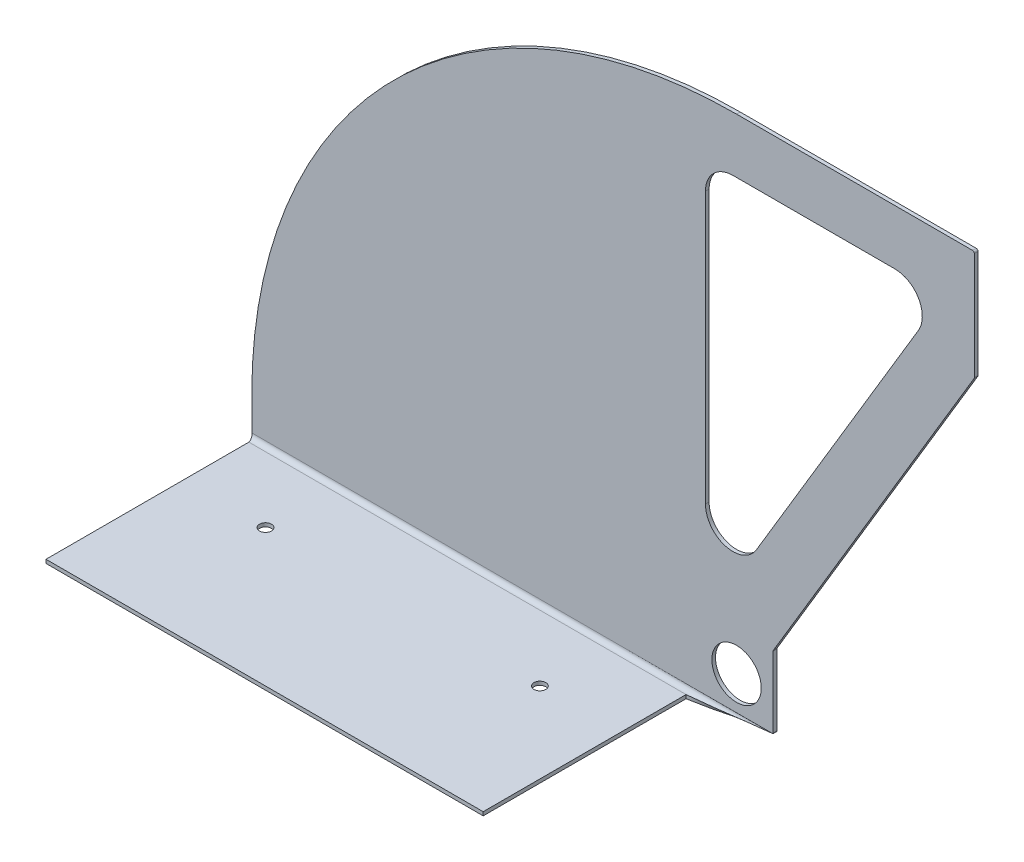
ISO-10303-21;
HEADER;
FILE_DESCRIPTION(('STEP AP214'),'2;1');
FILE_NAME('part.step','',(''),(''),'','','');
FILE_SCHEMA(('AUTOMOTIVE_DESIGN { 1 0 10303 214 1 1 1 1 }'));
ENDSEC;
DATA;
#1=APPLICATION_CONTEXT('core data for automotive mechanical design processes');
#2=APPLICATION_PROTOCOL_DEFINITION('international standard','automotive_design',2000,#1);
#3=PRODUCT_CONTEXT('',#1,'mechanical');
#4=PRODUCT('Part','Part','',(#3));
#5=PRODUCT_RELATED_PRODUCT_CATEGORY('part','',(#4));
#6=PRODUCT_DEFINITION_FORMATION('','',#4);
#7=PRODUCT_DEFINITION_CONTEXT('part definition',#1,'design');
#8=PRODUCT_DEFINITION('design','',#6,#7);
#9=PRODUCT_DEFINITION_SHAPE('','',#8);
#10=(LENGTH_UNIT() NAMED_UNIT(*) SI_UNIT(.MILLI.,.METRE.));
#11=(NAMED_UNIT(*) PLANE_ANGLE_UNIT() SI_UNIT($,.RADIAN.));
#12=(NAMED_UNIT(*) SI_UNIT($,.STERADIAN.) SOLID_ANGLE_UNIT());
#13=UNCERTAINTY_MEASURE_WITH_UNIT(LENGTH_MEASURE(1.E-05),#10,'distance_accuracy_value','');
#14=(GEOMETRIC_REPRESENTATION_CONTEXT(3) GLOBAL_UNCERTAINTY_ASSIGNED_CONTEXT((#13)) GLOBAL_UNIT_ASSIGNED_CONTEXT((#10,
#11,#12)) REPRESENTATION_CONTEXT('',''));
#15=CARTESIAN_POINT('',(0.,0.,0.));
#16=DIRECTION('',(0.,0.,1.));
#17=DIRECTION('',(1.,0.,0.));
#18=AXIS2_PLACEMENT_3D('',#15,#16,#17);
#19=CARTESIAN_POINT('',(-264.,-23.,231.));
#20=DIRECTION('',(0.,1.,0.));
#21=DIRECTION('',(-1.,0.,0.));
#22=AXIS2_PLACEMENT_3D('',#19,#20,#21);
#23=PLANE('',#22);
#24=CARTESIAN_POINT('',(-219.,-23.,40.5));
#25=DIRECTION('',(0.,-1.,0.));
#26=DIRECTION('',(1.,0.,0.));
#27=AXIS2_PLACEMENT_3D('',#24,#25,#26);
#28=CIRCLE('',#27,3.25000000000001);
#29=CARTESIAN_POINT('',(-215.75,-23.,40.5));
#30=VERTEX_POINT('',#29);
#31=EDGE_CURVE('E202',#30,#30,#28,.T.);
#32=ORIENTED_EDGE('',*,*,#31,.F.);
#33=EDGE_LOOP('',(#32));
#34=FACE_BOUND('',#33,.T.);
#35=CARTESIAN_POINT('',(-69.0000000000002,-23.,40.5));
#36=DIRECTION('',(0.,-1.,0.));
#37=DIRECTION('',(1.,0.,0.));
#38=AXIS2_PLACEMENT_3D('',#35,#36,#37);
#39=CIRCLE('',#38,3.25000000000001);
#40=CARTESIAN_POINT('',(-65.7500000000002,-23.,40.5));
#41=VERTEX_POINT('',#40);
#42=EDGE_CURVE('E205',#41,#41,#39,.T.);
#43=ORIENTED_EDGE('',*,*,#42,.F.);
#44=EDGE_LOOP('',(#43));
#45=FACE_BOUND('',#44,.T.);
#46=DIRECTION('',(-1.,0.,0.));
#47=VECTOR('',#46,1.);
#48=CARTESIAN_POINT('',(-264.,-23.,115.499999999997));
#49=LINE('',#48,#47);
#50=CARTESIAN_POINT('',(-25.,-23.,115.499999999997));
#51=VERTEX_POINT('',#50);
#52=CARTESIAN_POINT('',(-264.,-23.,115.499999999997));
#53=VERTEX_POINT('',#52);
#54=EDGE_CURVE('E170',#51,#53,#49,.T.);
#55=ORIENTED_EDGE('',*,*,#54,.T.);
#56=DIRECTION('',(0.,0.,-1.));
#57=VECTOR('',#56,1.);
#58=CARTESIAN_POINT('',(-264.,-23.,231.));
#59=LINE('',#58,#57);
#60=CARTESIAN_POINT('',(-264.,-23.,4.59999999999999));
#61=VERTEX_POINT('',#60);
#62=EDGE_CURVE('E176',#53,#61,#59,.T.);
#63=ORIENTED_EDGE('',*,*,#62,.T.);
#64=DIRECTION('',(-1.,0.,0.));
#65=VECTOR('',#64,1.);
#66=CARTESIAN_POINT('',(-25.,-23.,4.6));
#67=LINE('',#66,#65);
#68=CARTESIAN_POINT('',(-25.,-23.,4.6));
#69=VERTEX_POINT('',#68);
#70=EDGE_CURVE('E189',#69,#61,#67,.T.);
#71=ORIENTED_EDGE('',*,*,#70,.F.);
#72=DIRECTION('',(0.,0.,-1.));
#73=VECTOR('',#72,1.);
#74=CARTESIAN_POINT('',(-25.,-23.,231.));
#75=LINE('',#74,#73);
#76=EDGE_CURVE('E181',#51,#69,#75,.T.);
#77=ORIENTED_EDGE('',*,*,#76,.F.);
#78=EDGE_LOOP('',(#55,#63,#71,#77));
#79=FACE_BOUND('',#78,.T.);
#80=ADVANCED_FACE('F35',(#34,#45,#79),#23,.F.);
#81=CARTESIAN_POINT('',(130.,-21.,2.));
#82=DIRECTION('',(0.,-1.,0.));
#83=DIRECTION('',(0.,0.,-1.));
#84=AXIS2_PLACEMENT_3D('',#81,#82,#83);
#85=PLANE('',#84);
#86=CARTESIAN_POINT('',(-69.0000000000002,-21.,40.5));
#87=DIRECTION('',(0.,-1.,0.));
#88=DIRECTION('',(1.,0.,0.));
#89=AXIS2_PLACEMENT_3D('',#86,#87,#88);
#90=CIRCLE('',#89,3.25000000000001);
#91=CARTESIAN_POINT('',(-65.7500000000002,-21.,40.5));
#92=VERTEX_POINT('',#91);
#93=EDGE_CURVE('E213',#92,#92,#90,.T.);
#94=ORIENTED_EDGE('',*,*,#93,.T.);
#95=EDGE_LOOP('',(#94));
#96=FACE_BOUND('',#95,.T.);
#97=CARTESIAN_POINT('',(-219.,-21.,40.5));
#98=DIRECTION('',(0.,-1.,0.));
#99=DIRECTION('',(1.,0.,0.));
#100=AXIS2_PLACEMENT_3D('',#97,#98,#99);
#101=CIRCLE('',#100,3.25000000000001);
#102=CARTESIAN_POINT('',(-215.75,-21.,40.5));
#103=VERTEX_POINT('',#102);
#104=EDGE_CURVE('E210',#103,#103,#101,.T.);
#105=ORIENTED_EDGE('',*,*,#104,.T.);
#106=EDGE_LOOP('',(#105));
#107=FACE_BOUND('',#106,.T.);
#108=DIRECTION('',(-1.,0.,0.));
#109=VECTOR('',#108,1.);
#110=CARTESIAN_POINT('',(-264.,-21.,115.499999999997));
#111=LINE('',#110,#109);
#112=CARTESIAN_POINT('',(-25.,-21.,115.499999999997));
#113=VERTEX_POINT('',#112);
#114=CARTESIAN_POINT('',(-264.,-21.,115.499999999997));
#115=VERTEX_POINT('',#114);
#116=EDGE_CURVE('E12',#113,#115,#111,.T.);
#117=ORIENTED_EDGE('',*,*,#116,.F.);
#118=DIRECTION('',(0.,0.,1.));
#119=VECTOR('',#118,1.);
#120=CARTESIAN_POINT('',(-25.,-21.,231.));
#121=LINE('',#120,#119);
#122=CARTESIAN_POINT('',(-25.,-21.,4.6));
#123=VERTEX_POINT('',#122);
#124=EDGE_CURVE('E184',#123,#113,#121,.T.);
#125=ORIENTED_EDGE('',*,*,#124,.F.);
#126=DIRECTION('',(1.,0.,0.));
#127=VECTOR('',#126,1.);
#128=CARTESIAN_POINT('',(-25.,-21.,4.6));
#129=LINE('',#128,#127);
#130=CARTESIAN_POINT('',(-264.,-21.,4.6));
#131=VERTEX_POINT('',#130);
#132=EDGE_CURVE('E185',#131,#123,#129,.T.);
#133=ORIENTED_EDGE('',*,*,#132,.F.);
#134=DIRECTION('',(0.,0.,1.));
#135=VECTOR('',#134,1.);
#136=CARTESIAN_POINT('',(-264.,-21.,231.));
#137=LINE('',#136,#135);
#138=EDGE_CURVE('E193',#131,#115,#137,.T.);
#139=ORIENTED_EDGE('',*,*,#138,.T.);
#140=EDGE_LOOP('',(#117,#125,#133,#139));
#141=FACE_BOUND('',#140,.T.);
#142=ADVANCED_FACE('F236',(#96,#107,#141),#85,.F.);
#143=CARTESIAN_POINT('',(-25.,631.123423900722,231.));
#144=DIRECTION('',(1.,0.,0.));
#145=DIRECTION('',(0.,0.,-1.));
#146=AXIS2_PLACEMENT_3D('',#143,#144,#145);
#147=PLANE('',#146);
#148=ORIENTED_EDGE('',*,*,#124,.T.);
#149=DIRECTION('',(0.,-1.,0.));
#150=VECTOR('',#149,1.);
#151=CARTESIAN_POINT('',(-25.,-23.,115.499999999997));
#152=LINE('',#151,#150);
#153=EDGE_CURVE('E44',#51,#113,#152,.F.);
#154=ORIENTED_EDGE('',*,*,#153,.F.);
#155=ORIENTED_EDGE('',*,*,#76,.T.);
#156=CARTESIAN_POINT('',(-25.,-21.,4.6));
#157=CARTESIAN_POINT('',(-25.,-23.,4.6));
#158=B_SPLINE_CURVE_WITH_KNOTS('',1,(#156,#157),.UNSPECIFIED.,.F.,.F.,(2,2),(0.,1.),.UNSPECIFIED.);
#159=EDGE_CURVE('E295',#123,#69,#158,.T.);
#160=ORIENTED_EDGE('',*,*,#159,.F.);
#161=EDGE_LOOP('',(#148,#154,#155,#160));
#162=FACE_BOUND('',#161,.T.);
#163=ADVANCED_FACE('F179',(#162),#147,.T.);
#164=CARTESIAN_POINT('',(-264.,631.123423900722,231.));
#165=DIRECTION('',(-1.,0.,0.));
#166=DIRECTION('',(0.,0.,1.));
#167=AXIS2_PLACEMENT_3D('',#164,#165,#166);
#168=PLANE('',#167);
#169=ORIENTED_EDGE('',*,*,#62,.F.);
#170=DIRECTION('',(0.,-1.,0.));
#171=VECTOR('',#170,1.);
#172=CARTESIAN_POINT('',(-264.,-23.,115.499999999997));
#173=LINE('',#172,#171);
#174=EDGE_CURVE('E172',#53,#115,#173,.F.);
#175=ORIENTED_EDGE('',*,*,#174,.T.);
#176=ORIENTED_EDGE('',*,*,#138,.F.);
#177=CARTESIAN_POINT('',(-264.,-23.,4.6));
#178=CARTESIAN_POINT('',(-264.,-21.,4.6));
#179=B_SPLINE_CURVE_WITH_KNOTS('',1,(#177,#178),.UNSPECIFIED.,.F.,.F.,(2,2),(0.,1.),.UNSPECIFIED.);
#180=EDGE_CURVE('E191',#131,#61,#179,.F.);
#181=ORIENTED_EDGE('',*,*,#180,.T.);
#182=EDGE_LOOP('',(#169,#175,#176,#181));
#183=FACE_BOUND('',#182,.T.);
#184=ADVANCED_FACE('F372',(#183),#168,.T.);
#185=CARTESIAN_POINT('',(-17.,71.8982523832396,231.));
#186=DIRECTION('',(1.,0.,0.));
#187=DIRECTION('',(0.,1.,0.));
#188=AXIS2_PLACEMENT_3D('',#185,#186,#187);
#189=PLANE('',#188);
#190=DIRECTION('',(0.,1.,0.));
#191=VECTOR('',#190,1.);
#192=CARTESIAN_POINT('',(-17.,71.8982523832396,2.));
#193=LINE('',#192,#191);
#194=CARTESIAN_POINT('',(-17.,71.8982523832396,2.));
#195=VERTEX_POINT('',#194);
#196=CARTESIAN_POINT('',(-17.,220.,2.00000000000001));
#197=VERTEX_POINT('',#196);
#198=EDGE_CURVE('E907',#195,#197,#193,.T.);
#199=ORIENTED_EDGE('',*,*,#198,.F.);
#200=DIRECTION('',(0.,0.,-1.));
#201=VECTOR('',#200,1.);
#202=CARTESIAN_POINT('',(-17.,71.8982523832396,231.));
#203=LINE('',#202,#201);
#204=CARTESIAN_POINT('',(-17.,71.8982523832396,0.));
#205=VERTEX_POINT('',#204);
#206=EDGE_CURVE('E374',#195,#205,#203,.T.);
#207=ORIENTED_EDGE('',*,*,#206,.T.);
#208=DIRECTION('',(0.,-1.,0.));
#209=VECTOR('',#208,1.);
#210=CARTESIAN_POINT('',(-17.,71.8982523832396,0.));
#211=LINE('',#210,#209);
#212=CARTESIAN_POINT('',(-17.,220.,0.));
#213=VERTEX_POINT('',#212);
#214=EDGE_CURVE('E899',#213,#205,#211,.T.);
#215=ORIENTED_EDGE('',*,*,#214,.F.);
#216=DIRECTION('',(0.,0.,-1.));
#217=VECTOR('',#216,1.);
#218=CARTESIAN_POINT('',(-17.,220.,231.));
#219=LINE('',#218,#217);
#220=EDGE_CURVE('E802',#197,#213,#219,.T.);
#221=ORIENTED_EDGE('',*,*,#220,.F.);
#222=EDGE_LOOP('',(#199,#207,#215,#221));
#223=FACE_BOUND('',#222,.T.);
#224=ADVANCED_FACE('F406',(#223),#189,.T.);
#225=CARTESIAN_POINT('',(-2.00000000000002,220.,231.));
#226=DIRECTION('',(0.,0.,-1.));
#227=DIRECTION('',(-1.,0.,0.));
#228=AXIS2_PLACEMENT_3D('',#225,#226,#227);
#229=CYLINDRICAL_SURFACE('',#228,15.);
#230=CARTESIAN_POINT('',(-2.00000000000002,220.,2.00000000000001));
#231=DIRECTION('',(0.,0.,-1.));
#232=DIRECTION('',(-1.,0.,0.));
#233=AXIS2_PLACEMENT_3D('',#230,#231,#232);
#234=CIRCLE('',#233,15.);
#235=CARTESIAN_POINT('',(-2.00000000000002,235.,2.00000000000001));
#236=VERTEX_POINT('',#235);
#237=EDGE_CURVE('E909',#197,#236,#234,.T.);
#238=ORIENTED_EDGE('',*,*,#237,.F.);
#239=ORIENTED_EDGE('',*,*,#220,.T.);
#240=CARTESIAN_POINT('',(-2.00000000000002,220.,0.));
#241=DIRECTION('',(0.,0.,1.));
#242=DIRECTION('',(-1.,0.,0.));
#243=AXIS2_PLACEMENT_3D('',#240,#241,#242);
#244=CIRCLE('',#243,15.);
#245=CARTESIAN_POINT('',(-2.00000000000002,235.,0.));
#246=VERTEX_POINT('',#245);
#247=EDGE_CURVE('E897',#246,#213,#244,.T.);
#248=ORIENTED_EDGE('',*,*,#247,.F.);
#249=DIRECTION('',(0.,0.,-1.));
#250=VECTOR('',#249,1.);
#251=CARTESIAN_POINT('',(-2.00000000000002,235.,231.));
#252=LINE('',#251,#250);
#253=EDGE_CURVE('E805',#236,#246,#252,.T.);
#254=ORIENTED_EDGE('',*,*,#253,.F.);
#255=EDGE_LOOP('',(#238,#239,#248,#254));
#256=FACE_BOUND('',#255,.T.);
#257=ADVANCED_FACE('F452',(#256),#229,.F.);
#258=CARTESIAN_POINT('',(-2.00000000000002,235.,231.));
#259=DIRECTION('',(0.,-1.,0.));
#260=DIRECTION('',(1.,0.,0.));
#261=AXIS2_PLACEMENT_3D('',#258,#259,#260);
#262=PLANE('',#261);
#263=DIRECTION('',(1.,0.,0.));
#264=VECTOR('',#263,1.);
#265=CARTESIAN_POINT('',(-2.00000000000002,235.,2.00000000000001));
#266=LINE('',#265,#264);
#267=CARTESIAN_POINT('',(86.5390882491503,235.,2.00000000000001));
#268=VERTEX_POINT('',#267);
#269=EDGE_CURVE('E911',#236,#268,#266,.T.);
#270=ORIENTED_EDGE('',*,*,#269,.F.);
#271=ORIENTED_EDGE('',*,*,#253,.T.);
#272=DIRECTION('',(-1.,0.,0.));
#273=VECTOR('',#272,1.);
#274=CARTESIAN_POINT('',(-2.00000000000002,235.,0.));
#275=LINE('',#274,#273);
#276=CARTESIAN_POINT('',(86.5390882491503,235.,0.));
#277=VERTEX_POINT('',#276);
#278=EDGE_CURVE('E895',#277,#246,#275,.T.);
#279=ORIENTED_EDGE('',*,*,#278,.F.);
#280=DIRECTION('',(0.,0.,-1.));
#281=VECTOR('',#280,1.);
#282=CARTESIAN_POINT('',(86.5390882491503,235.,231.));
#283=LINE('',#282,#281);
#284=EDGE_CURVE('E808',#268,#277,#283,.T.);
#285=ORIENTED_EDGE('',*,*,#284,.F.);
#286=EDGE_LOOP('',(#270,#271,#279,#285));
#287=FACE_BOUND('',#286,.T.);
#288=ADVANCED_FACE('F459',(#287),#262,.T.);
#289=CARTESIAN_POINT('',(86.5390882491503,220.,231.));
#290=DIRECTION('',(0.,0.,-1.));
#291=DIRECTION('',(-1.,0.,0.));
#292=AXIS2_PLACEMENT_3D('',#289,#290,#291);
#293=CYLINDRICAL_SURFACE('',#292,15.);
#294=CARTESIAN_POINT('',(86.5390882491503,220.,2.00000000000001));
#295=DIRECTION('',(0.,0.,-1.));
#296=DIRECTION('',(-1.,0.,0.));
#297=AXIS2_PLACEMENT_3D('',#294,#295,#296);
#298=CIRCLE('',#297,15.);
#299=CARTESIAN_POINT('',(99.4138135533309,212.303153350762,2.00000000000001));
#300=VERTEX_POINT('',#299);
#301=EDGE_CURVE('E912',#268,#300,#298,.T.);
#302=ORIENTED_EDGE('',*,*,#301,.F.);
#303=ORIENTED_EDGE('',*,*,#284,.T.);
#304=CARTESIAN_POINT('',(86.5390882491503,220.,0.));
#305=DIRECTION('',(0.,0.,1.));
#306=DIRECTION('',(1.,0.,0.));
#307=AXIS2_PLACEMENT_3D('',#304,#305,#306);
#308=CIRCLE('',#307,15.);
#309=CARTESIAN_POINT('',(99.4138135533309,212.303153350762,0.));
#310=VERTEX_POINT('',#309);
#311=EDGE_CURVE('E893',#310,#277,#308,.T.);
#312=ORIENTED_EDGE('',*,*,#311,.F.);
#313=DIRECTION('',(0.,0.,-1.));
#314=VECTOR('',#313,1.);
#315=CARTESIAN_POINT('',(99.4138135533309,212.303153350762,231.));
#316=LINE('',#315,#314);
#317=EDGE_CURVE('E811',#300,#310,#316,.T.);
#318=ORIENTED_EDGE('',*,*,#317,.F.);
#319=EDGE_LOOP('',(#302,#303,#312,#318));
#320=FACE_BOUND('',#319,.T.);
#321=ADVANCED_FACE('F466',(#320),#293,.F.);
#322=CARTESIAN_POINT('',(99.4138135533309,212.303153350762,231.));
#323=DIRECTION('',(-0.858315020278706,0.513123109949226,0.));
#324=DIRECTION('',(-0.513123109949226,-0.858315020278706,0.));
#325=AXIS2_PLACEMENT_3D('',#322,#323,#324);
#326=PLANE('',#325);
#327=DIRECTION('',(-0.513123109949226,-0.858315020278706,0.));
#328=VECTOR('',#327,1.);
#329=CARTESIAN_POINT('',(99.4138135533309,212.303153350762,2.00000000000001));
#330=LINE('',#329,#328);
#331=CARTESIAN_POINT('',(10.8747253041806,64.2014057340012,2.00000000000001));
#332=VERTEX_POINT('',#331);
#333=EDGE_CURVE('E396',#300,#332,#330,.T.);
#334=ORIENTED_EDGE('',*,*,#333,.F.);
#335=ORIENTED_EDGE('',*,*,#317,.T.);
#336=DIRECTION('',(0.513123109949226,0.858315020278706,0.));
#337=VECTOR('',#336,1.);
#338=CARTESIAN_POINT('',(99.4138135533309,212.303153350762,0.));
#339=LINE('',#338,#337);
#340=CARTESIAN_POINT('',(10.8747253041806,64.2014057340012,0.));
#341=VERTEX_POINT('',#340);
#342=EDGE_CURVE('E891',#341,#310,#339,.T.);
#343=ORIENTED_EDGE('',*,*,#342,.F.);
#344=DIRECTION('',(0.,0.,-1.));
#345=VECTOR('',#344,1.);
#346=CARTESIAN_POINT('',(10.8747253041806,64.2014057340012,231.));
#347=LINE('',#346,#345);
#348=EDGE_CURVE('E814',#332,#341,#347,.T.);
#349=ORIENTED_EDGE('',*,*,#348,.F.);
#350=EDGE_LOOP('',(#334,#335,#343,#349));
#351=FACE_BOUND('',#350,.T.);
#352=ADVANCED_FACE('F474',(#351),#326,.T.);
#353=CARTESIAN_POINT('',(-1.99999999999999,71.8982523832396,231.));
#354=DIRECTION('',(0.,0.,-1.));
#355=DIRECTION('',(-1.,0.,0.));
#356=AXIS2_PLACEMENT_3D('',#353,#354,#355);
#357=CYLINDRICAL_SURFACE('',#356,15.);
#358=CARTESIAN_POINT('',(-1.99999999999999,71.8982523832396,2.));
#359=DIRECTION('',(0.,0.,-1.));
#360=DIRECTION('',(-1.,0.,0.));
#361=AXIS2_PLACEMENT_3D('',#358,#359,#360);
#362=CIRCLE('',#361,15.);
#363=EDGE_CURVE('E905',#332,#195,#362,.T.);
#364=ORIENTED_EDGE('',*,*,#363,.F.);
#365=ORIENTED_EDGE('',*,*,#348,.T.);
#366=CARTESIAN_POINT('',(-1.99999999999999,71.8982523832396,0.));
#367=DIRECTION('',(0.,0.,1.));
#368=DIRECTION('',(-1.,0.,0.));
#369=AXIS2_PLACEMENT_3D('',#366,#367,#368);
#370=CIRCLE('',#369,15.);
#371=EDGE_CURVE('E792',#205,#341,#370,.T.);
#372=ORIENTED_EDGE('',*,*,#371,.F.);
#373=ORIENTED_EDGE('',*,*,#206,.F.);
#374=EDGE_LOOP('',(#364,#365,#372,#373));
#375=FACE_BOUND('',#374,.T.);
#376=ADVANCED_FACE('F482',(#375),#357,.F.);
#377=CARTESIAN_POINT('',(21.,20.7238772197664,974.29740306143));
#378=DIRECTION('',(0.,0.,-1.));
#379=DIRECTION('',(0.,1.,0.));
#380=AXIS2_PLACEMENT_3D('',#377,#378,#379);
#381=CYLINDRICAL_SURFACE('',#380,0.999999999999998);
#382=CARTESIAN_POINT('',(21.,20.7238772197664,0.));
#383=DIRECTION('',(0.,0.,-1.));
#384=DIRECTION('',(-1.,0.,0.));
#385=AXIS2_PLACEMENT_3D('',#382,#383,#384);
#386=CIRCLE('',#385,0.999999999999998);
#387=CARTESIAN_POINT('',(20.,20.7238772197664,0.));
#388=VERTEX_POINT('',#387);
#389=CARTESIAN_POINT('',(20.1416849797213,21.2370003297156,0.));
#390=VERTEX_POINT('',#389);
#391=EDGE_CURVE('E817',#388,#390,#386,.T.);
#392=ORIENTED_EDGE('',*,*,#391,.T.);
#393=DIRECTION('',(0.,0.,-1.));
#394=VECTOR('',#393,1.);
#395=CARTESIAN_POINT('',(20.1416849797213,21.2370003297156,974.29740306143));
#396=LINE('',#395,#394);
#397=CARTESIAN_POINT('',(20.1416849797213,21.2370003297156,2.));
#398=VERTEX_POINT('',#397);
#399=EDGE_CURVE('E832',#398,#390,#396,.T.);
#400=ORIENTED_EDGE('',*,*,#399,.F.);
#401=CARTESIAN_POINT('',(21.,20.7238772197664,2.));
#402=DIRECTION('',(0.,0.,-1.));
#403=DIRECTION('',(-1.,0.,0.));
#404=AXIS2_PLACEMENT_3D('',#401,#402,#403);
#405=CIRCLE('',#404,0.999999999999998);
#406=CARTESIAN_POINT('',(20.,20.7238772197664,2.));
#407=VERTEX_POINT('',#406);
#408=EDGE_CURVE('E820',#398,#407,#405,.F.);
#409=ORIENTED_EDGE('',*,*,#408,.T.);
#410=DIRECTION('',(0.,0.,-1.));
#411=VECTOR('',#410,1.);
#412=CARTESIAN_POINT('',(20.,20.7238772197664,974.29740306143));
#413=LINE('',#412,#411);
#414=EDGE_CURVE('E823',#407,#388,#413,.T.);
#415=ORIENTED_EDGE('',*,*,#414,.T.);
#416=EDGE_LOOP('',(#392,#400,#409,#415));
#417=FACE_BOUND('',#416,.T.);
#418=ADVANCED_FACE('F490',(#417),#381,.F.);
#419=CARTESIAN_POINT('',(20.1416849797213,21.2370003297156,974.29740306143));
#420=DIRECTION('',(0.858315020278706,-0.513123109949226,0.));
#421=DIRECTION('',(0.513123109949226,0.858315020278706,0.));
#422=AXIS2_PLACEMENT_3D('',#419,#420,#421);
#423=PLANE('',#422);
#424=DIRECTION('',(0.513123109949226,0.858315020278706,0.));
#425=VECTOR('',#424,1.);
#426=CARTESIAN_POINT('',(20.1416849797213,21.2370003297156,0.));
#427=LINE('',#426,#425);
#428=CARTESIAN_POINT('',(129.858315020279,204.762999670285,0.));
#429=VERTEX_POINT('',#428);
#430=EDGE_CURVE('E826',#390,#429,#427,.T.);
#431=ORIENTED_EDGE('',*,*,#430,.T.);
#432=DIRECTION('',(0.,0.,-1.));
#433=VECTOR('',#432,1.);
#434=CARTESIAN_POINT('',(129.858315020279,204.762999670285,974.29740306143));
#435=LINE('',#434,#433);
#436=CARTESIAN_POINT('',(129.858315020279,204.762999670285,2.00000000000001));
#437=VERTEX_POINT('',#436);
#438=EDGE_CURVE('E841',#437,#429,#435,.T.);
#439=ORIENTED_EDGE('',*,*,#438,.F.);
#440=DIRECTION('',(-0.513123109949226,-0.858315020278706,0.));
#441=VECTOR('',#440,1.);
#442=CARTESIAN_POINT('',(20.1416849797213,21.2370003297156,2.));
#443=LINE('',#442,#441);
#444=EDGE_CURVE('E829',#437,#398,#443,.T.);
#445=ORIENTED_EDGE('',*,*,#444,.T.);
#446=ORIENTED_EDGE('',*,*,#399,.T.);
#447=EDGE_LOOP('',(#431,#439,#445,#446));
#448=FACE_BOUND('',#447,.T.);
#449=ADVANCED_FACE('F498',(#448),#423,.T.);
#450=CARTESIAN_POINT('',(129.,205.276122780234,974.29740306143));
#451=DIRECTION('',(0.,0.,-1.));
#452=DIRECTION('',(0.,1.,0.));
#453=AXIS2_PLACEMENT_3D('',#450,#451,#452);
#454=CYLINDRICAL_SURFACE('',#453,0.999999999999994);
#455=CARTESIAN_POINT('',(129.,205.276122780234,0.));
#456=DIRECTION('',(0.,0.,1.));
#457=DIRECTION('',(-1.,0.,0.));
#458=AXIS2_PLACEMENT_3D('',#455,#456,#457);
#459=CIRCLE('',#458,0.999999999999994);
#460=CARTESIAN_POINT('',(130.,205.276122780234,0.));
#461=VERTEX_POINT('',#460);
#462=EDGE_CURVE('E835',#429,#461,#459,.T.);
#463=ORIENTED_EDGE('',*,*,#462,.T.);
#464=DIRECTION('',(0.,0.,-1.));
#465=VECTOR('',#464,1.);
#466=CARTESIAN_POINT('',(130.,205.276122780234,974.29740306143));
#467=LINE('',#466,#465);
#468=CARTESIAN_POINT('',(130.,205.276122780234,2.));
#469=VERTEX_POINT('',#468);
#470=EDGE_CURVE('E850',#469,#461,#467,.T.);
#471=ORIENTED_EDGE('',*,*,#470,.F.);
#472=CARTESIAN_POINT('',(129.,205.276122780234,2.00000000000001));
#473=DIRECTION('',(0.,0.,-1.));
#474=DIRECTION('',(-1.,0.,0.));
#475=AXIS2_PLACEMENT_3D('',#472,#473,#474);
#476=CIRCLE('',#475,0.999999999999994);
#477=EDGE_CURVE('E838',#469,#437,#476,.T.);
#478=ORIENTED_EDGE('',*,*,#477,.T.);
#479=ORIENTED_EDGE('',*,*,#438,.T.);
#480=EDGE_LOOP('',(#463,#471,#478,#479));
#481=FACE_BOUND('',#480,.T.);
#482=ADVANCED_FACE('F506',(#481),#454,.T.);
#483=CARTESIAN_POINT('',(130.,-21.,974.29740306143));
#484=DIRECTION('',(1.,0.,0.));
#485=DIRECTION('',(0.,1.,0.));
#486=AXIS2_PLACEMENT_3D('',#483,#484,#485);
#487=PLANE('',#486);
#488=DIRECTION('',(0.,1.,0.));
#489=VECTOR('',#488,1.);
#490=CARTESIAN_POINT('',(130.,264.,0.));
#491=LINE('',#490,#489);
#492=CARTESIAN_POINT('',(130.,264.,0.));
#493=VERTEX_POINT('',#492);
#494=EDGE_CURVE('E844',#461,#493,#491,.T.);
#495=ORIENTED_EDGE('',*,*,#494,.T.);
#496=DIRECTION('',(0.,0.,-1.));
#497=VECTOR('',#496,1.);
#498=CARTESIAN_POINT('',(130.,264.,974.29740306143));
#499=LINE('',#498,#497);
#500=CARTESIAN_POINT('',(130.,264.,2.));
#501=VERTEX_POINT('',#500);
#502=EDGE_CURVE('E859',#501,#493,#499,.T.);
#503=ORIENTED_EDGE('',*,*,#502,.F.);
#504=DIRECTION('',(0.,-1.,0.));
#505=VECTOR('',#504,1.);
#506=CARTESIAN_POINT('',(130.,-21.,2.));
#507=LINE('',#506,#505);
#508=EDGE_CURVE('E847',#501,#469,#507,.T.);
#509=ORIENTED_EDGE('',*,*,#508,.T.);
#510=ORIENTED_EDGE('',*,*,#470,.T.);
#511=EDGE_LOOP('',(#495,#503,#509,#510));
#512=FACE_BOUND('',#511,.T.);
#513=ADVANCED_FACE('F514',(#512),#487,.T.);
#514=CARTESIAN_POINT('',(129.,264.,974.29740306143));
#515=DIRECTION('',(0.,0.,-1.));
#516=DIRECTION('',(0.,1.,0.));
#517=AXIS2_PLACEMENT_3D('',#514,#515,#516);
#518=CYLINDRICAL_SURFACE('',#517,1.00000000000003);
#519=CARTESIAN_POINT('',(129.,264.,0.));
#520=DIRECTION('',(0.,0.,1.));
#521=DIRECTION('',(1.,0.,0.));
#522=AXIS2_PLACEMENT_3D('',#519,#520,#521);
#523=CIRCLE('',#522,1.00000000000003);
#524=CARTESIAN_POINT('',(129.,265.,0.));
#525=VERTEX_POINT('',#524);
#526=EDGE_CURVE('E853',#493,#525,#523,.T.);
#527=ORIENTED_EDGE('',*,*,#526,.T.);
#528=DIRECTION('',(0.,0.,-1.));
#529=VECTOR('',#528,1.);
#530=CARTESIAN_POINT('',(129.,265.,974.29740306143));
#531=LINE('',#530,#529);
#532=CARTESIAN_POINT('',(129.,265.,2.00000000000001));
#533=VERTEX_POINT('',#532);
#534=EDGE_CURVE('E868',#533,#525,#531,.T.);
#535=ORIENTED_EDGE('',*,*,#534,.F.);
#536=CARTESIAN_POINT('',(129.,264.,2.00000000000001));
#537=DIRECTION('',(0.,0.,-1.));
#538=DIRECTION('',(-1.,0.,0.));
#539=AXIS2_PLACEMENT_3D('',#536,#537,#538);
#540=CIRCLE('',#539,1.00000000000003);
#541=EDGE_CURVE('E856',#533,#501,#540,.T.);
#542=ORIENTED_EDGE('',*,*,#541,.T.);
#543=ORIENTED_EDGE('',*,*,#502,.T.);
#544=EDGE_LOOP('',(#527,#535,#542,#543));
#545=FACE_BOUND('',#544,.T.);
#546=ADVANCED_FACE('F522',(#545),#518,.T.);
#547=CARTESIAN_POINT('',(0.,265.,974.29740306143));
#548=DIRECTION('',(0.,1.,0.));
#549=DIRECTION('',(-1.,0.,0.));
#550=AXIS2_PLACEMENT_3D('',#547,#548,#549);
#551=PLANE('',#550);
#552=DIRECTION('',(-1.,0.,0.));
#553=VECTOR('',#552,1.);
#554=CARTESIAN_POINT('',(0.,265.,0.));
#555=LINE('',#554,#553);
#556=CARTESIAN_POINT('',(0.,265.,0.));
#557=VERTEX_POINT('',#556);
#558=EDGE_CURVE('E862',#525,#557,#555,.T.);
#559=ORIENTED_EDGE('',*,*,#558,.T.);
#560=DIRECTION('',(0.,0.,-1.));
#561=VECTOR('',#560,1.);
#562=CARTESIAN_POINT('',(0.,265.,974.29740306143));
#563=LINE('',#562,#561);
#564=CARTESIAN_POINT('',(0.,265.,2.00000000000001));
#565=VERTEX_POINT('',#564);
#566=EDGE_CURVE('E877',#565,#557,#563,.T.);
#567=ORIENTED_EDGE('',*,*,#566,.F.);
#568=DIRECTION('',(1.,0.,0.));
#569=VECTOR('',#568,1.);
#570=CARTESIAN_POINT('',(0.,265.,2.00000000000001));
#571=LINE('',#570,#569);
#572=EDGE_CURVE('E865',#565,#533,#571,.T.);
#573=ORIENTED_EDGE('',*,*,#572,.T.);
#574=ORIENTED_EDGE('',*,*,#534,.T.);
#575=EDGE_LOOP('',(#559,#567,#573,#574));
#576=FACE_BOUND('',#575,.T.);
#577=ADVANCED_FACE('F530',(#576),#551,.T.);
#578=CARTESIAN_POINT('',(0.,0.,974.29740306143));
#579=DIRECTION('',(0.,0.,-1.));
#580=DIRECTION('',(0.,1.,0.));
#581=AXIS2_PLACEMENT_3D('',#578,#579,#580);
#582=CYLINDRICAL_SURFACE('',#581,265.);
#583=CARTESIAN_POINT('',(0.,0.,0.));
#584=DIRECTION('',(0.,0.,1.));
#585=DIRECTION('',(1.,0.,0.));
#586=AXIS2_PLACEMENT_3D('',#583,#584,#585);
#587=CIRCLE('',#586,265.);
#588=CARTESIAN_POINT('',(-265.,0.,0.));
#589=VERTEX_POINT('',#588);
#590=EDGE_CURVE('E871',#557,#589,#587,.T.);
#591=ORIENTED_EDGE('',*,*,#590,.T.);
#592=DIRECTION('',(0.,0.,-1.));
#593=VECTOR('',#592,1.);
#594=CARTESIAN_POINT('',(-265.,0.,974.29740306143));
#595=LINE('',#594,#593);
#596=CARTESIAN_POINT('',(-265.,0.,1.99999999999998));
#597=VERTEX_POINT('',#596);
#598=EDGE_CURVE('E799',#597,#589,#595,.T.);
#599=ORIENTED_EDGE('',*,*,#598,.F.);
#600=CARTESIAN_POINT('',(0.,0.,2.00000000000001));
#601=DIRECTION('',(0.,0.,-1.));
#602=DIRECTION('',(-1.,0.,0.));
#603=AXIS2_PLACEMENT_3D('',#600,#601,#602);
#604=CIRCLE('',#603,265.);
#605=EDGE_CURVE('E874',#597,#565,#604,.T.);
#606=ORIENTED_EDGE('',*,*,#605,.T.);
#607=ORIENTED_EDGE('',*,*,#566,.T.);
#608=EDGE_LOOP('',(#591,#599,#606,#607));
#609=FACE_BOUND('',#608,.T.);
#610=ADVANCED_FACE('F538',(#609),#582,.T.);
#611=CARTESIAN_POINT('',(0.,0.,231.));
#612=DIRECTION('',(0.,0.,-1.));
#613=DIRECTION('',(-1.,0.,0.));
#614=AXIS2_PLACEMENT_3D('',#611,#612,#613);
#615=CYLINDRICAL_SURFACE('',#614,13.5);
#616=CARTESIAN_POINT('',(0.,0.,2.00000000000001));
#617=DIRECTION('',(0.,0.,-1.));
#618=DIRECTION('',(-1.,0.,0.));
#619=AXIS2_PLACEMENT_3D('',#616,#617,#618);
#620=CIRCLE('',#619,13.5);
#621=CARTESIAN_POINT('',(-13.5,0.,2.00000000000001));
#622=VERTEX_POINT('',#621);
#623=EDGE_CURVE('E798',#622,#622,#620,.T.);
#624=ORIENTED_EDGE('',*,*,#623,.F.);
#625=EDGE_LOOP('',(#624));
#626=FACE_BOUND('',#625,.T.);
#627=CARTESIAN_POINT('',(0.,0.,0.));
#628=DIRECTION('',(0.,0.,1.));
#629=DIRECTION('',(1.,0.,0.));
#630=AXIS2_PLACEMENT_3D('',#627,#628,#629);
#631=CIRCLE('',#630,13.5);
#632=CARTESIAN_POINT('',(13.5,0.,0.));
#633=VERTEX_POINT('',#632);
#634=EDGE_CURVE('E793',#633,#633,#631,.T.);
#635=ORIENTED_EDGE('',*,*,#634,.F.);
#636=EDGE_LOOP('',(#635));
#637=FACE_BOUND('',#636,.T.);
#638=ADVANCED_FACE('F546',(#626,#637),#615,.F.);
#639=CARTESIAN_POINT('',(20.,-18.,974.29740306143));
#640=DIRECTION('',(1.,0.,0.));
#641=DIRECTION('',(0.,1.,0.));
#642=AXIS2_PLACEMENT_3D('',#639,#640,#641);
#643=PLANE('',#642);
#644=DIRECTION('',(0.,1.,0.));
#645=VECTOR('',#644,1.);
#646=CARTESIAN_POINT('',(20.,-18.,0.));
#647=LINE('',#646,#645);
#648=CARTESIAN_POINT('',(20.,-18.,0.));
#649=VERTEX_POINT('',#648);
#650=EDGE_CURVE('E880',#649,#388,#647,.T.);
#651=ORIENTED_EDGE('',*,*,#650,.T.);
#652=ORIENTED_EDGE('',*,*,#414,.F.);
#653=DIRECTION('',(0.,-1.,0.));
#654=VECTOR('',#653,1.);
#655=CARTESIAN_POINT('',(20.,-18.,2.00000000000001));
#656=LINE('',#655,#654);
#657=CARTESIAN_POINT('',(20.,-18.,2.00000000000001));
#658=VERTEX_POINT('',#657);
#659=EDGE_CURVE('E883',#407,#658,#656,.T.);
#660=ORIENTED_EDGE('',*,*,#659,.T.);
#661=DIRECTION('',(0.,0.,-1.));
#662=VECTOR('',#661,1.);
#663=CARTESIAN_POINT('',(20.,-18.,974.29740306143));
#664=LINE('',#663,#662);
#665=EDGE_CURVE('E788',#658,#649,#664,.T.);
#666=ORIENTED_EDGE('',*,*,#665,.T.);
#667=EDGE_LOOP('',(#651,#652,#660,#666));
#668=FACE_BOUND('',#667,.T.);
#669=ADVANCED_FACE('F554',(#668),#643,.T.);
#670=CARTESIAN_POINT('',(19.,-18.,974.29740306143));
#671=DIRECTION('',(0.,0.,-1.));
#672=DIRECTION('',(0.,1.,0.));
#673=AXIS2_PLACEMENT_3D('',#670,#671,#672);
#674=CYLINDRICAL_SURFACE('',#673,1.);
#675=CARTESIAN_POINT('',(19.,-18.,0.));
#676=DIRECTION('',(0.,0.,1.));
#677=DIRECTION('',(-1.,0.,0.));
#678=AXIS2_PLACEMENT_3D('',#675,#676,#677);
#679=CIRCLE('',#678,1.);
#680=CARTESIAN_POINT('',(19.9165151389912,-18.4,0.));
#681=VERTEX_POINT('',#680);
#682=EDGE_CURVE('E769',#681,#649,#679,.T.);
#683=ORIENTED_EDGE('',*,*,#682,.T.);
#684=ORIENTED_EDGE('',*,*,#665,.F.);
#685=CARTESIAN_POINT('',(19.,-18.,2.00000000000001));
#686=DIRECTION('',(0.,0.,-1.));
#687=DIRECTION('',(-1.,0.,0.));
#688=AXIS2_PLACEMENT_3D('',#685,#686,#687);
#689=CIRCLE('',#688,1.);
#690=CARTESIAN_POINT('',(19.9165151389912,-18.4,2.));
#691=VERTEX_POINT('',#690);
#692=EDGE_CURVE('E766',#658,#691,#689,.T.);
#693=ORIENTED_EDGE('',*,*,#692,.T.);
#694=CARTESIAN_POINT('',(19.9165151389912,-18.4,0.));
#695=CARTESIAN_POINT('',(19.9165151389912,-18.4,2.));
#696=B_SPLINE_CURVE_WITH_KNOTS('',1,(#694,#695),.UNSPECIFIED.,.F.,.F.,(2,2),(0.,1.),.UNSPECIFIED.);
#697=EDGE_CURVE('E286',#691,#681,#696,.F.);
#698=ORIENTED_EDGE('',*,*,#697,.T.);
#699=EDGE_LOOP('',(#683,#684,#693,#698));
#700=FACE_BOUND('',#699,.T.);
#701=ADVANCED_FACE('F562',(#700),#674,.T.);
#702=CARTESIAN_POINT('',(0.,0.,0.));
#703=DIRECTION('',(0.,0.,1.));
#704=DIRECTION('',(1.,0.,0.));
#705=AXIS2_PLACEMENT_3D('',#702,#703,#704);
#706=PLANE('',#705);
#707=ORIENTED_EDGE('',*,*,#634,.T.);
#708=EDGE_LOOP('',(#707));
#709=FACE_BOUND('',#708,.T.);
#710=ORIENTED_EDGE('',*,*,#682,.F.);
#711=DIRECTION('',(-1.,0.,0.));
#712=VECTOR('',#711,1.);
#713=CARTESIAN_POINT('',(19.9165151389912,-18.4,0.));
#714=LINE('',#713,#712);
#715=CARTESIAN_POINT('',(-265.,-18.4,0.));
#716=VERTEX_POINT('',#715);
#717=EDGE_CURVE('E307',#681,#716,#714,.T.);
#718=ORIENTED_EDGE('',*,*,#717,.T.);
#719=DIRECTION('',(0.,-1.,0.));
#720=VECTOR('',#719,1.);
#721=CARTESIAN_POINT('',(-265.,0.,0.));
#722=LINE('',#721,#720);
#723=EDGE_CURVE('E796',#589,#716,#722,.T.);
#724=ORIENTED_EDGE('',*,*,#723,.F.);
#725=ORIENTED_EDGE('',*,*,#590,.F.);
#726=ORIENTED_EDGE('',*,*,#558,.F.);
#727=ORIENTED_EDGE('',*,*,#526,.F.);
#728=ORIENTED_EDGE('',*,*,#494,.F.);
#729=ORIENTED_EDGE('',*,*,#462,.F.);
#730=ORIENTED_EDGE('',*,*,#430,.F.);
#731=ORIENTED_EDGE('',*,*,#391,.F.);
#732=ORIENTED_EDGE('',*,*,#650,.F.);
#733=EDGE_LOOP('',(#710,#718,#724,#725,#726,#727,#728,#729,#730,#731,#732));
#734=FACE_BOUND('',#733,.T.);
#735=ORIENTED_EDGE('',*,*,#371,.T.);
#736=ORIENTED_EDGE('',*,*,#342,.T.);
#737=ORIENTED_EDGE('',*,*,#311,.T.);
#738=ORIENTED_EDGE('',*,*,#278,.T.);
#739=ORIENTED_EDGE('',*,*,#247,.T.);
#740=ORIENTED_EDGE('',*,*,#214,.T.);
#741=EDGE_LOOP('',(#735,#736,#737,#738,#739,#740));
#742=FACE_BOUND('',#741,.T.);
#743=ADVANCED_FACE('F570',(#709,#734,#742),#706,.F.);
#744=CARTESIAN_POINT('',(-265.,-21.,974.29740306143));
#745=DIRECTION('',(1.,0.,0.));
#746=DIRECTION('',(0.,1.,0.));
#747=AXIS2_PLACEMENT_3D('',#744,#745,#746);
#748=PLANE('',#747);
#749=ORIENTED_EDGE('',*,*,#598,.T.);
#750=ORIENTED_EDGE('',*,*,#723,.T.);
#751=CARTESIAN_POINT('',(-265.,-18.4000000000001,2.));
#752=CARTESIAN_POINT('',(-265.,-18.4000000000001,0.));
#753=B_SPLINE_CURVE_WITH_KNOTS('',1,(#751,#752),.UNSPECIFIED.,.F.,.F.,(2,2),(0.,1.),.UNSPECIFIED.);
#754=CARTESIAN_POINT('',(-265.,-18.4,2.));
#755=VERTEX_POINT('',#754);
#756=EDGE_CURVE('E272',#755,#716,#753,.T.);
#757=ORIENTED_EDGE('',*,*,#756,.F.);
#758=DIRECTION('',(0.,-1.,0.));
#759=VECTOR('',#758,1.);
#760=CARTESIAN_POINT('',(-265.,-21.,2.));
#761=LINE('',#760,#759);
#762=EDGE_CURVE('E761',#597,#755,#761,.T.);
#763=ORIENTED_EDGE('',*,*,#762,.F.);
#764=EDGE_LOOP('',(#749,#750,#757,#763));
#765=FACE_BOUND('',#764,.T.);
#766=ADVANCED_FACE('F578',(#765),#748,.F.);
#767=CARTESIAN_POINT('',(130.,-21.,2.));
#768=DIRECTION('',(0.,0.,-1.));
#769=DIRECTION('',(-1.,0.,0.));
#770=AXIS2_PLACEMENT_3D('',#767,#768,#769);
#771=PLANE('',#770);
#772=ORIENTED_EDGE('',*,*,#623,.T.);
#773=EDGE_LOOP('',(#772));
#774=FACE_BOUND('',#773,.T.);
#775=ORIENTED_EDGE('',*,*,#363,.T.);
#776=ORIENTED_EDGE('',*,*,#198,.T.);
#777=ORIENTED_EDGE('',*,*,#237,.T.);
#778=ORIENTED_EDGE('',*,*,#269,.T.);
#779=ORIENTED_EDGE('',*,*,#301,.T.);
#780=ORIENTED_EDGE('',*,*,#333,.T.);
#781=EDGE_LOOP('',(#775,#776,#777,#778,#779,#780));
#782=FACE_BOUND('',#781,.T.);
#783=ORIENTED_EDGE('',*,*,#762,.T.);
#784=DIRECTION('',(1.,0.,0.));
#785=VECTOR('',#784,1.);
#786=CARTESIAN_POINT('',(19.9165151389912,-18.4,1.99999999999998));
#787=LINE('',#786,#785);
#788=EDGE_CURVE('E206',#755,#691,#787,.T.);
#789=ORIENTED_EDGE('',*,*,#788,.T.);
#790=ORIENTED_EDGE('',*,*,#692,.F.);
#791=ORIENTED_EDGE('',*,*,#659,.F.);
#792=ORIENTED_EDGE('',*,*,#408,.F.);
#793=ORIENTED_EDGE('',*,*,#444,.F.);
#794=ORIENTED_EDGE('',*,*,#477,.F.);
#795=ORIENTED_EDGE('',*,*,#508,.F.);
#796=ORIENTED_EDGE('',*,*,#541,.F.);
#797=ORIENTED_EDGE('',*,*,#572,.F.);
#798=ORIENTED_EDGE('',*,*,#605,.F.);
#799=EDGE_LOOP('',(#783,#789,#790,#791,#792,#793,#794,#795,#796,#797,#798));
#800=FACE_BOUND('',#799,.T.);
#801=ADVANCED_FACE('F415',(#774,#782,#800),#771,.F.);
#802=CARTESIAN_POINT('',(-219.,-21.,40.5));
#803=DIRECTION('',(0.,-1.,0.));
#804=DIRECTION('',(1.,0.,0.));
#805=AXIS2_PLACEMENT_3D('',#802,#803,#804);
#806=CYLINDRICAL_SURFACE('',#805,3.25000000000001);
#807=ORIENTED_EDGE('',*,*,#104,.F.);
#808=EDGE_LOOP('',(#807));
#809=FACE_BOUND('',#808,.T.);
#810=ORIENTED_EDGE('',*,*,#31,.T.);
#811=EDGE_LOOP('',(#810));
#812=FACE_BOUND('',#811,.T.);
#813=ADVANCED_FACE('F411',(#809,#812),#806,.F.);
#814=CARTESIAN_POINT('',(-69.0000000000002,-21.,40.5));
#815=DIRECTION('',(0.,-1.,0.));
#816=DIRECTION('',(1.,0.,0.));
#817=AXIS2_PLACEMENT_3D('',#814,#815,#816);
#818=CYLINDRICAL_SURFACE('',#817,3.25000000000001);
#819=ORIENTED_EDGE('',*,*,#93,.F.);
#820=EDGE_LOOP('',(#819));
#821=FACE_BOUND('',#820,.T.);
#822=ORIENTED_EDGE('',*,*,#42,.T.);
#823=EDGE_LOOP('',(#822));
#824=FACE_BOUND('',#823,.T.);
#825=ADVANCED_FACE('F414',(#821,#824),#818,.F.);
#826=CARTESIAN_POINT('',(19.9165151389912,-18.4,0.));
#827=CARTESIAN_POINT('',(16.173455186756,-19.0021413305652,0.));
#828=CARTESIAN_POINT('',(12.4304292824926,-19.6040402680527,0.11972568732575));
#829=CARTESIAN_POINT('',(4.94434342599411,-20.7166473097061,0.580582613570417));
#830=CARTESIAN_POINT('',(1.20130049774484,-21.2269149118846,0.921532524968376));
#831=CARTESIAN_POINT('',(-6.28478535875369,-22.0784674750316,1.7730850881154));
#832=CARTESIAN_POINT('',(-10.027828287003,-22.4194173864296,2.28335269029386));
#833=CARTESIAN_POINT('',(-17.5139141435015,-22.8802743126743,3.39595973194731));
#834=CARTESIAN_POINT('',(-21.2569400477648,-23.,3.99785866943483));
#835=CARTESIAN_POINT('',(-25.,-23.,4.6));
#836=CARTESIAN_POINT('',(19.9165151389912,-18.4,2.));
#837=CARTESIAN_POINT('',(16.1734666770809,-18.7403397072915,2.));
#838=CARTESIAN_POINT('',(12.4304292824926,-19.0805444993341,2.06767104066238));
#839=CARTESIAN_POINT('',(4.94434342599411,-19.7094093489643,2.32815539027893));
#840=CARTESIAN_POINT('',(1.20130049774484,-19.9978214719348,2.52086620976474));
#841=CARTESIAN_POINT('',(-6.28478535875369,-20.4791337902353,3.00217852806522));
#842=CARTESIAN_POINT('',(-10.027828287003,-20.6718446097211,3.29059065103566));
#843=CARTESIAN_POINT('',(-17.5139141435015,-20.9323289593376,3.91945550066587));
#844=CARTESIAN_POINT('',(-21.2569515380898,-21.,4.25966029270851));
#845=CARTESIAN_POINT('',(-25.,-21.,4.6));
#846=B_SPLINE_SURFACE_WITH_KNOTS('',1,3,((#826,#827,#828,#829,#830,#831,#832,#833,#834,#835),
(#836,#837,#838,#839,#840,#841,#842,#843,#844,#845)),.UNSPECIFIED.,.F.,.F.,.F.,(2,2),(4,2,2,2,
4),(0.,1.),(0.,0.25,0.5,0.75,1.),.UNSPECIFIED.);
#847=CARTESIAN_POINT('',(19.9165151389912,-18.4,2.));
#848=CARTESIAN_POINT('',(16.1734666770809,-18.7403397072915,2.));
#849=CARTESIAN_POINT('',(12.4304292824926,-19.0805444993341,2.06767104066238));
#850=CARTESIAN_POINT('',(4.94434342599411,-19.7094093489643,2.32815539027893));
#851=CARTESIAN_POINT('',(1.20130049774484,-19.9978214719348,2.52086620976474));
#852=CARTESIAN_POINT('',(-6.28478535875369,-20.4791337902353,3.00217852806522));
#853=CARTESIAN_POINT('',(-10.027828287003,-20.6718446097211,3.29059065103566));
#854=CARTESIAN_POINT('',(-17.5139141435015,-20.9323289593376,3.91945550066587));
#855=CARTESIAN_POINT('',(-21.2569515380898,-21.,4.25966029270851));
#856=CARTESIAN_POINT('',(-25.,-21.,4.6));
#857=B_SPLINE_CURVE_WITH_KNOTS('',3,(#847,#848,#849,#850,#851,#852,#853,#854,#855,#856),
.UNSPECIFIED.,.F.,.F.,(4,2,2,2,4),(0.,0.25,0.5,0.75,1.),.UNSPECIFIED.);
#858=EDGE_CURVE('E209',#691,#123,#857,.T.);
#859=CARTESIAN_POINT('',(-25.,-23.,4.6));
#860=CARTESIAN_POINT('',(-21.2569400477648,-23.,3.99785866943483));
#861=CARTESIAN_POINT('',(-17.5139141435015,-22.8802743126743,3.39595973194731));
#862=CARTESIAN_POINT('',(-10.027828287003,-22.4194173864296,2.28335269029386));
#863=CARTESIAN_POINT('',(-6.28478535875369,-22.0784674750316,1.7730850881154));
#864=CARTESIAN_POINT('',(1.20130049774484,-21.2269149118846,0.921532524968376));
#865=CARTESIAN_POINT('',(4.94434342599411,-20.7166473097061,0.580582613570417));
#866=CARTESIAN_POINT('',(12.4304292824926,-19.6040402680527,0.11972568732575));
#867=CARTESIAN_POINT('',(16.173455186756,-19.0021413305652,0.));
#868=CARTESIAN_POINT('',(19.9165151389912,-18.4,0.));
#869=B_SPLINE_CURVE_WITH_KNOTS('',3,(#859,#860,#861,#862,#863,#864,#865,#866,#867,#868),
.UNSPECIFIED.,.F.,.F.,(4,2,2,2,4),(0.,0.25,0.5,0.75,1.),.UNSPECIFIED.);
#870=EDGE_CURVE('E297',#681,#69,#869,.F.);
#871=ORIENTED_EDGE('',*,*,#697,.F.);
#872=ORIENTED_EDGE('',*,*,#858,.T.);
#873=ORIENTED_EDGE('',*,*,#159,.T.);
#874=ORIENTED_EDGE('',*,*,#870,.F.);
#875=EDGE_LOOP('',(#871,#872,#873,#874));
#876=FACE_BOUND('',#875,.T.);
#877=ADVANCED_FACE('F234',(#876),#846,.T.);
#878=CARTESIAN_POINT('',(-264.,-23.,4.6));
#879=CARTESIAN_POINT('',(-264.08334807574,-23.,3.99775488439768));
#880=CARTESIAN_POINT('',(-264.166666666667,-22.8802743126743,3.39595973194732));
#881=CARTESIAN_POINT('',(-264.333333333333,-22.4194173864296,2.28335269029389));
#882=CARTESIAN_POINT('',(-264.416666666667,-22.0784674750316,1.77308508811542));
#883=CARTESIAN_POINT('',(-264.583333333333,-21.2269149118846,0.921532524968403));
#884=CARTESIAN_POINT('',(-264.666666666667,-20.7166473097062,0.580582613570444));
#885=CARTESIAN_POINT('',(-264.833333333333,-19.6040402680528,0.119725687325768));
#886=CARTESIAN_POINT('',(-264.91665192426,-19.0022451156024,0.));
#887=CARTESIAN_POINT('',(-265.,-18.4000000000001,0.));
#888=CARTESIAN_POINT('',(-264.,-21.,4.6));
#889=CARTESIAN_POINT('',(-264.083347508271,-21.,4.25960290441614));
#890=CARTESIAN_POINT('',(-264.166666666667,-20.9323289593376,3.91945550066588));
#891=CARTESIAN_POINT('',(-264.333333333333,-20.6718446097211,3.29059065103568));
#892=CARTESIAN_POINT('',(-264.416666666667,-20.4791337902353,3.00217852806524));
#893=CARTESIAN_POINT('',(-264.583333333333,-19.9978214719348,2.52086620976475));
#894=CARTESIAN_POINT('',(-264.666666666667,-19.7094093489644,2.32815539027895));
#895=CARTESIAN_POINT('',(-264.833333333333,-19.0805444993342,2.06767104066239));
#896=CARTESIAN_POINT('',(-264.916652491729,-18.7403970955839,2.00000000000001));
#897=CARTESIAN_POINT('',(-265.,-18.4000000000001,2.));
#898=B_SPLINE_SURFACE_WITH_KNOTS('',1,3,((#878,#879,#880,#881,#882,#883,#884,#885,#886,#887),
(#888,#889,#890,#891,#892,#893,#894,#895,#896,#897)),.UNSPECIFIED.,.F.,.F.,.F.,(2,2),(4,2,2,2,
4),(0.,1.),(0.,0.25,0.5,0.75,1.),.UNSPECIFIED.);
#899=CARTESIAN_POINT('',(-264.,-21.,4.6));
#900=CARTESIAN_POINT('',(-264.083347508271,-21.,4.25960290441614));
#901=CARTESIAN_POINT('',(-264.166666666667,-20.9323289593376,3.91945550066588));
#902=CARTESIAN_POINT('',(-264.333333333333,-20.6718446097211,3.29059065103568));
#903=CARTESIAN_POINT('',(-264.416666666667,-20.4791337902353,3.00217852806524));
#904=CARTESIAN_POINT('',(-264.583333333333,-19.9978214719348,2.52086620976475));
#905=CARTESIAN_POINT('',(-264.666666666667,-19.7094093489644,2.32815539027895));
#906=CARTESIAN_POINT('',(-264.833333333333,-19.0805444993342,2.06767104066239));
#907=CARTESIAN_POINT('',(-264.916652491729,-18.7403970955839,2.00000000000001));
#908=CARTESIAN_POINT('',(-265.,-18.4000000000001,2.));
#909=B_SPLINE_CURVE_WITH_KNOTS('',3,(#899,#900,#901,#902,#903,#904,#905,#906,#907,#908),
.UNSPECIFIED.,.F.,.F.,(4,2,2,2,4),(0.,0.25,0.5,0.75,1.),.UNSPECIFIED.);
#910=EDGE_CURVE('E303',#131,#755,#909,.T.);
#911=CARTESIAN_POINT('',(-265.,-18.4000000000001,0.));
#912=CARTESIAN_POINT('',(-264.91665192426,-19.0022451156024,0.));
#913=CARTESIAN_POINT('',(-264.833333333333,-19.6040402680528,0.119725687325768));
#914=CARTESIAN_POINT('',(-264.666666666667,-20.7166473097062,0.580582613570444));
#915=CARTESIAN_POINT('',(-264.583333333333,-21.2269149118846,0.921532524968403));
#916=CARTESIAN_POINT('',(-264.416666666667,-22.0784674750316,1.77308508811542));
#917=CARTESIAN_POINT('',(-264.333333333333,-22.4194173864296,2.28335269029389));
#918=CARTESIAN_POINT('',(-264.166666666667,-22.8802743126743,3.39595973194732));
#919=CARTESIAN_POINT('',(-264.08334807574,-23.,3.99775488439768));
#920=CARTESIAN_POINT('',(-264.,-23.,4.6));
#921=B_SPLINE_CURVE_WITH_KNOTS('',3,(#911,#912,#913,#914,#915,#916,#917,#918,#919,#920),
.UNSPECIFIED.,.F.,.F.,(4,2,2,2,4),(0.,0.25,0.5,0.75,1.),.UNSPECIFIED.);
#922=EDGE_CURVE('E308',#61,#716,#921,.F.);
#923=ORIENTED_EDGE('',*,*,#910,.T.);
#924=ORIENTED_EDGE('',*,*,#756,.T.);
#925=ORIENTED_EDGE('',*,*,#922,.F.);
#926=ORIENTED_EDGE('',*,*,#180,.F.);
#927=EDGE_LOOP('',(#923,#924,#925,#926));
#928=FACE_BOUND('',#927,.T.);
#929=ADVANCED_FACE('F221',(#928),#898,.T.);
#930=CARTESIAN_POINT('',(685.060519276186,-18.4,4.6));
#931=DIRECTION('',(-1.,0.,0.));
#932=DIRECTION('',(0.,0.,1.));
#933=AXIS2_PLACEMENT_3D('',#930,#931,#932);
#934=CYLINDRICAL_SURFACE('',#933,4.6);
#935=ORIENTED_EDGE('',*,*,#70,.T.);
#936=ORIENTED_EDGE('',*,*,#922,.T.);
#937=ORIENTED_EDGE('',*,*,#717,.F.);
#938=ORIENTED_EDGE('',*,*,#870,.T.);
#939=EDGE_LOOP('',(#935,#936,#937,#938));
#940=FACE_BOUND('',#939,.T.);
#941=ADVANCED_FACE('F233',(#940),#934,.T.);
#942=CARTESIAN_POINT('',(685.060519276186,-18.4,4.6));
#943=DIRECTION('',(-1.,0.,0.));
#944=DIRECTION('',(0.,0.,1.));
#945=AXIS2_PLACEMENT_3D('',#942,#943,#944);
#946=CYLINDRICAL_SURFACE('',#945,2.6);
#947=ORIENTED_EDGE('',*,*,#132,.T.);
#948=ORIENTED_EDGE('',*,*,#858,.F.);
#949=ORIENTED_EDGE('',*,*,#788,.F.);
#950=ORIENTED_EDGE('',*,*,#910,.F.);
#951=EDGE_LOOP('',(#947,#948,#949,#950));
#952=FACE_BOUND('',#951,.T.);
#953=ADVANCED_FACE('F321',(#952),#946,.F.);
#954=CARTESIAN_POINT('',(-264.,-23.,115.499999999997));
#955=DIRECTION('',(0.,0.,-1.));
#956=DIRECTION('',(-1.,0.,0.));
#957=AXIS2_PLACEMENT_3D('',#954,#955,#956);
#958=PLANE('',#957);
#959=ORIENTED_EDGE('',*,*,#174,.F.);
#960=ORIENTED_EDGE('',*,*,#54,.F.);
#961=ORIENTED_EDGE('',*,*,#153,.T.);
#962=ORIENTED_EDGE('',*,*,#116,.T.);
#963=EDGE_LOOP('',(#959,#960,#961,#962));
#964=FACE_BOUND('',#963,.T.);
#965=ADVANCED_FACE('F37',(#964),#958,.F.);
#966=CLOSED_SHELL('',(#80,#142,#163,#184,#224,#257,#288,#321,#352,#376,#418,#449,#482,#513,#546,
#577,#610,#638,#669,#701,#743,#766,#801,#813,#825,#877,#929,#941,#953,#965));
#967=MANIFOLD_SOLID_BREP('B2',#966);
#968=ADVANCED_BREP_SHAPE_REPRESENTATION('',(#18,#967),#14);
#969=SHAPE_DEFINITION_REPRESENTATION(#9,#968);
ENDSEC;
END-ISO-10303-21;
